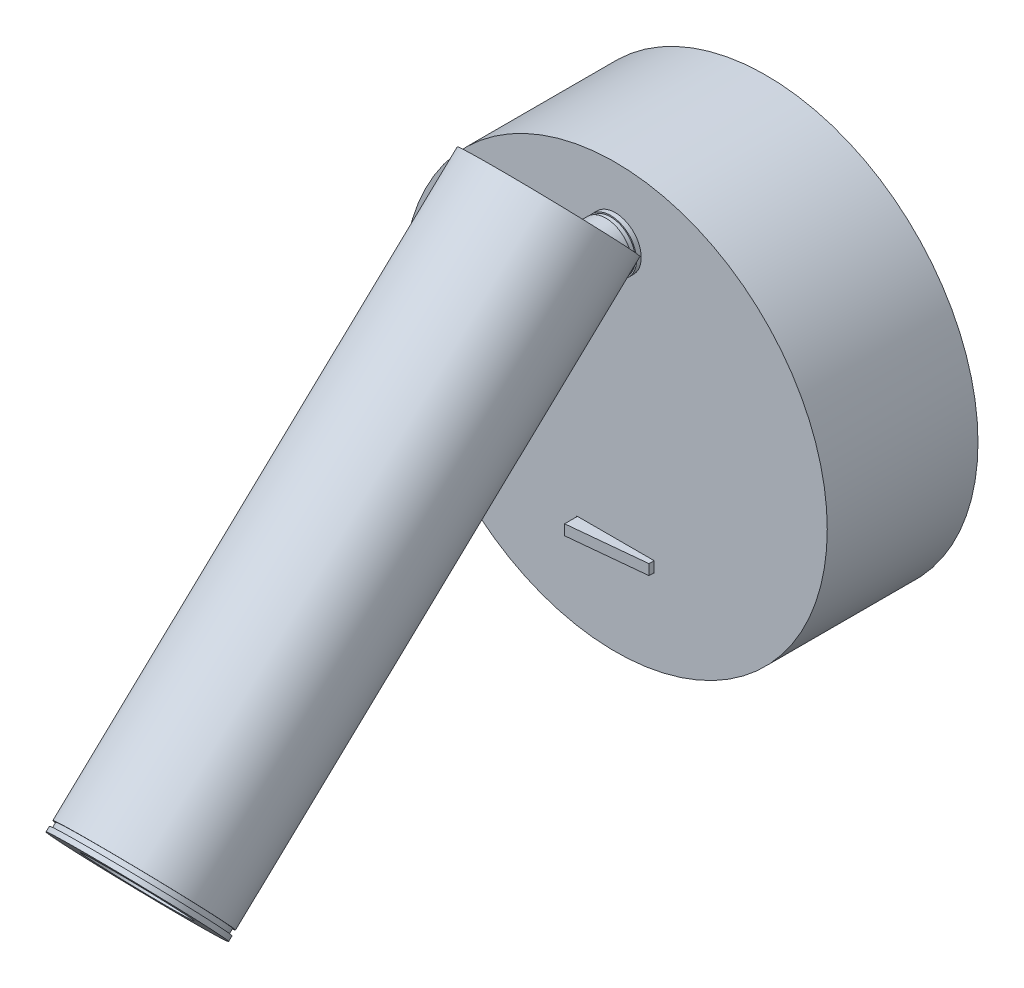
ISO-10303-21;
HEADER;
FILE_DESCRIPTION(('STEP AP214'),'2;1');
FILE_NAME('part.step','',(''),(''),'','','');
FILE_SCHEMA(('AUTOMOTIVE_DESIGN { 1 0 10303 214 1 1 1 1 }'));
ENDSEC;
DATA;
#1=APPLICATION_CONTEXT('core data for automotive mechanical design processes');
#2=APPLICATION_PROTOCOL_DEFINITION('international standard','automotive_design',2000,#1);
#3=PRODUCT_CONTEXT('',#1,'mechanical');
#4=PRODUCT('Part','Part','',(#3));
#5=PRODUCT_RELATED_PRODUCT_CATEGORY('part','',(#4));
#6=PRODUCT_DEFINITION_FORMATION('','',#4);
#7=PRODUCT_DEFINITION_CONTEXT('part definition',#1,'design');
#8=PRODUCT_DEFINITION('design','',#6,#7);
#9=PRODUCT_DEFINITION_SHAPE('','',#8);
#10=(LENGTH_UNIT() NAMED_UNIT(*) SI_UNIT(.MILLI.,.METRE.));
#11=(NAMED_UNIT(*) PLANE_ANGLE_UNIT() SI_UNIT($,.RADIAN.));
#12=(NAMED_UNIT(*) SI_UNIT($,.STERADIAN.) SOLID_ANGLE_UNIT());
#13=UNCERTAINTY_MEASURE_WITH_UNIT(LENGTH_MEASURE(1.E-05),#10,'distance_accuracy_value','');
#14=(GEOMETRIC_REPRESENTATION_CONTEXT(3) GLOBAL_UNCERTAINTY_ASSIGNED_CONTEXT((#13)) GLOBAL_UNIT_ASSIGNED_CONTEXT((#10,
#11,#12)) REPRESENTATION_CONTEXT('',''));
#15=CARTESIAN_POINT('',(0.,0.,0.));
#16=DIRECTION('',(0.,0.,1.));
#17=DIRECTION('',(1.,0.,0.));
#18=AXIS2_PLACEMENT_3D('',#15,#16,#17);
#19=CARTESIAN_POINT('',(-8.1430770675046,-26.4426643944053,35.));
#20=DIRECTION('',(0.,1.,0.));
#21=DIRECTION('',(0.,0.,1.));
#22=AXIS2_PLACEMENT_3D('',#19,#20,#21);
#23=PLANE('',#22);
#24=DIRECTION('',(0.,0.,-1.));
#25=VECTOR('',#24,1.);
#26=CARTESIAN_POINT('',(8.1430770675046,-26.4426643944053,35.));
#27=LINE('',#26,#25);
#28=CARTESIAN_POINT('',(8.1430770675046,-26.4426643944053,33.));
#29=VERTEX_POINT('',#28);
#30=CARTESIAN_POINT('',(8.1430770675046,-26.4426643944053,31.));
#31=VERTEX_POINT('',#30);
#32=EDGE_CURVE('E91',#29,#31,#27,.T.);
#33=ORIENTED_EDGE('',*,*,#32,.F.);
#34=DIRECTION('',(-0.995037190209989,0.,0.099503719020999));
#35=VECTOR('',#34,1.);
#36=CARTESIAN_POINT('',(-11.8569229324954,-26.4426643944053,35.));
#37=LINE('',#36,#35);
#38=CARTESIAN_POINT('',(-8.1430770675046,-26.4426643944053,34.6286154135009));
#39=VERTEX_POINT('',#38);
#40=EDGE_CURVE('E12',#29,#39,#37,.T.);
#41=ORIENTED_EDGE('',*,*,#40,.T.);
#42=DIRECTION('',(0.,0.,-1.));
#43=VECTOR('',#42,1.);
#44=CARTESIAN_POINT('',(-8.1430770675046,-26.4426643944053,35.));
#45=LINE('',#44,#43);
#46=CARTESIAN_POINT('',(-8.1430770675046,-26.4426643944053,31.));
#47=VERTEX_POINT('',#46);
#48=EDGE_CURVE('E110',#39,#47,#45,.T.);
#49=ORIENTED_EDGE('',*,*,#48,.T.);
#50=DIRECTION('',(1.,0.,0.));
#51=VECTOR('',#50,1.);
#52=CARTESIAN_POINT('',(-8.1430770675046,-26.4426643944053,31.));
#53=LINE('',#52,#51);
#54=EDGE_CURVE('E105',#47,#31,#53,.T.);
#55=ORIENTED_EDGE('',*,*,#54,.T.);
#56=EDGE_LOOP('',(#33,#41,#49,#55));
#57=FACE_BOUND('',#56,.T.);
#58=ADVANCED_FACE('F50',(#57),#23,.F.);
#59=CARTESIAN_POINT('',(8.1430770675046,-26.4426643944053,35.));
#60=DIRECTION('',(-1.,0.,0.));
#61=DIRECTION('',(0.,0.,1.));
#62=AXIS2_PLACEMENT_3D('',#59,#60,#61);
#63=PLANE('',#62);
#64=DIRECTION('',(0.,0.,-1.));
#65=VECTOR('',#64,1.);
#66=CARTESIAN_POINT('',(8.1430770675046,-24.2360908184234,35.));
#67=LINE('',#66,#65);
#68=CARTESIAN_POINT('',(8.1430770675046,-24.2360908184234,33.));
#69=VERTEX_POINT('',#68);
#70=CARTESIAN_POINT('',(8.1430770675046,-24.2360908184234,31.));
#71=VERTEX_POINT('',#70);
#72=EDGE_CURVE('E99',#69,#71,#67,.T.);
#73=ORIENTED_EDGE('',*,*,#72,.F.);
#74=DIRECTION('',(0.,-1.,0.));
#75=VECTOR('',#74,1.);
#76=CARTESIAN_POINT('',(8.1430770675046,-26.4426643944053,33.));
#77=LINE('',#76,#75);
#78=EDGE_CURVE('E58',#69,#29,#77,.T.);
#79=ORIENTED_EDGE('',*,*,#78,.T.);
#80=ORIENTED_EDGE('',*,*,#32,.T.);
#81=DIRECTION('',(0.,1.,0.));
#82=VECTOR('',#81,1.);
#83=CARTESIAN_POINT('',(8.1430770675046,-26.4426643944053,31.));
#84=LINE('',#83,#82);
#85=EDGE_CURVE('E94',#31,#71,#84,.T.);
#86=ORIENTED_EDGE('',*,*,#85,.T.);
#87=EDGE_LOOP('',(#73,#79,#80,#86));
#88=FACE_BOUND('',#87,.T.);
#89=ADVANCED_FACE('F93',(#88),#63,.F.);
#90=CARTESIAN_POINT('',(8.1430770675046,-24.2360908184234,35.));
#91=DIRECTION('',(0.,-1.,0.));
#92=DIRECTION('',(0.,0.,-1.));
#93=AXIS2_PLACEMENT_3D('',#90,#91,#92);
#94=PLANE('',#93);
#95=DIRECTION('',(0.,0.,-1.));
#96=VECTOR('',#95,1.);
#97=CARTESIAN_POINT('',(-8.1430770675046,-24.2360908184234,35.));
#98=LINE('',#97,#96);
#99=CARTESIAN_POINT('',(-8.1430770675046,-24.2360908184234,34.6286154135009));
#100=VERTEX_POINT('',#99);
#101=CARTESIAN_POINT('',(-8.1430770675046,-24.2360908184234,31.));
#102=VERTEX_POINT('',#101);
#103=EDGE_CURVE('E118',#100,#102,#98,.T.);
#104=ORIENTED_EDGE('',*,*,#103,.F.);
#105=DIRECTION('',(0.995037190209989,0.,-0.099503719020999));
#106=VECTOR('',#105,1.);
#107=CARTESIAN_POINT('',(-11.8569229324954,-24.2360908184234,35.));
#108=LINE('',#107,#106);
#109=EDGE_CURVE('E71',#100,#69,#108,.T.);
#110=ORIENTED_EDGE('',*,*,#109,.T.);
#111=ORIENTED_EDGE('',*,*,#72,.T.);
#112=DIRECTION('',(-1.,0.,0.));
#113=VECTOR('',#112,1.);
#114=CARTESIAN_POINT('',(8.1430770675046,-24.2360908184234,31.));
#115=LINE('',#114,#113);
#116=EDGE_CURVE('E107',#71,#102,#115,.T.);
#117=ORIENTED_EDGE('',*,*,#116,.T.);
#118=EDGE_LOOP('',(#104,#110,#111,#117));
#119=FACE_BOUND('',#118,.T.);
#120=ADVANCED_FACE('F124',(#119),#94,.F.);
#121=CARTESIAN_POINT('',(-8.1430770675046,-24.2360908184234,35.));
#122=DIRECTION('',(1.,0.,0.));
#123=DIRECTION('',(0.,0.,-1.));
#124=AXIS2_PLACEMENT_3D('',#121,#122,#123);
#125=PLANE('',#124);
#126=ORIENTED_EDGE('',*,*,#48,.F.);
#127=DIRECTION('',(0.,1.,0.));
#128=VECTOR('',#127,1.);
#129=CARTESIAN_POINT('',(-8.1430770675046,0.,34.6286154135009));
#130=LINE('',#129,#128);
#131=EDGE_CURVE('E98',#39,#100,#130,.T.);
#132=ORIENTED_EDGE('',*,*,#131,.T.);
#133=ORIENTED_EDGE('',*,*,#103,.T.);
#134=DIRECTION('',(0.,-1.,0.));
#135=VECTOR('',#134,1.);
#136=CARTESIAN_POINT('',(-8.1430770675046,-24.2360908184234,31.));
#137=LINE('',#136,#135);
#138=EDGE_CURVE('E115',#102,#47,#137,.T.);
#139=ORIENTED_EDGE('',*,*,#138,.T.);
#140=EDGE_LOOP('',(#126,#132,#133,#139));
#141=FACE_BOUND('',#140,.T.);
#142=ADVANCED_FACE('F123',(#141),#125,.F.);
#143=CARTESIAN_POINT('',(0.,0.,31.));
#144=DIRECTION('',(0.,0.,1.));
#145=DIRECTION('',(1.,0.,0.));
#146=AXIS2_PLACEMENT_3D('',#143,#144,#145);
#147=PLANE('',#146);
#148=ORIENTED_EDGE('',*,*,#54,.F.);
#149=ORIENTED_EDGE('',*,*,#138,.F.);
#150=ORIENTED_EDGE('',*,*,#116,.F.);
#151=ORIENTED_EDGE('',*,*,#85,.F.);
#152=EDGE_LOOP('',(#148,#149,#150,#151));
#153=FACE_BOUND('',#152,.T.);
#154=ADVANCED_FACE('F103',(#153),#147,.F.);
#155=CARTESIAN_POINT('',(-11.8569229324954,0.,35.));
#156=DIRECTION('',(0.099503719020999,0.,0.995037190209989));
#157=DIRECTION('',(0.,-1.,0.));
#158=AXIS2_PLACEMENT_3D('',#155,#156,#157);
#159=PLANE('',#158);
#160=ORIENTED_EDGE('',*,*,#40,.F.);
#161=ORIENTED_EDGE('',*,*,#78,.F.);
#162=ORIENTED_EDGE('',*,*,#109,.F.);
#163=ORIENTED_EDGE('',*,*,#131,.F.);
#164=EDGE_LOOP('',(#160,#161,#162,#163));
#165=FACE_BOUND('',#164,.T.);
#166=ADVANCED_FACE('F52',(#165),#159,.T.);
#167=CLOSED_SHELL('',(#58,#89,#120,#142,#154,#166));
#168=MANIFOLD_SOLID_BREP('B2',#167);
#169=CARTESIAN_POINT('',(0.,30.218938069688,59.7984728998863));
#170=DIRECTION('',(0.,0.,-1.));
#171=DIRECTION('',(-1.,0.,0.));
#172=AXIS2_PLACEMENT_3D('',#169,#170,#171);
#173=CYLINDRICAL_SURFACE('',#172,5.5);
#174=CARTESIAN_POINT('',(0.,30.218938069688,59.7984728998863));
#175=DIRECTION('',(0.,0.,1.));
#176=DIRECTION('',(1.,0.,0.));
#177=AXIS2_PLACEMENT_3D('',#174,#175,#176);
#178=CIRCLE('',#177,5.5);
#179=CARTESIAN_POINT('',(5.5,30.218938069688,59.7984728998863));
#180=VERTEX_POINT('',#179);
#181=EDGE_CURVE('E49',#180,#180,#178,.T.);
#182=ORIENTED_EDGE('',*,*,#181,.F.);
#183=EDGE_LOOP('',(#182));
#184=FACE_BOUND('',#183,.T.);
#185=CARTESIAN_POINT('',(0.,30.218938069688,39.7984728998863));
#186=DIRECTION('',(0.,0.,1.));
#187=DIRECTION('',(1.,0.,0.));
#188=AXIS2_PLACEMENT_3D('',#185,#186,#187);
#189=CIRCLE('',#188,5.5);
#190=CARTESIAN_POINT('',(5.5,30.218938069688,39.7984728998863));
#191=VERTEX_POINT('',#190);
#192=EDGE_CURVE('E187',#191,#191,#189,.T.);
#193=ORIENTED_EDGE('',*,*,#192,.T.);
#194=EDGE_LOOP('',(#193));
#195=FACE_BOUND('',#194,.T.);
#196=ADVANCED_FACE('F184',(#184,#195),#173,.T.);
#197=CARTESIAN_POINT('',(0.,30.218938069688,59.7984728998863));
#198=DIRECTION('',(0.,0.,1.));
#199=DIRECTION('',(1.,0.,0.));
#200=AXIS2_PLACEMENT_3D('',#197,#198,#199);
#201=PLANE('',#200);
#202=ORIENTED_EDGE('',*,*,#181,.T.);
#203=EDGE_LOOP('',(#202));
#204=FACE_BOUND('',#203,.T.);
#205=ADVANCED_FACE('F199',(#204),#201,.T.);
#206=CARTESIAN_POINT('',(0.,30.218938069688,39.7984728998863));
#207=DIRECTION('',(0.,0.,1.));
#208=DIRECTION('',(1.,0.,0.));
#209=AXIS2_PLACEMENT_3D('',#206,#207,#208);
#210=PLANE('',#209);
#211=ORIENTED_EDGE('',*,*,#192,.F.);
#212=EDGE_LOOP('',(#211));
#213=FACE_BOUND('',#212,.T.);
#214=ADVANCED_FACE('F197',(#213),#210,.F.);
#215=CLOSED_SHELL('',(#196,#205,#214));
#216=MANIFOLD_SOLID_BREP('B6',#215);
#217=CARTESIAN_POINT('',(0.,-37.4736596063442,133.494908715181));
#218=DIRECTION('',(0.,-0.685846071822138,0.727746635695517));
#219=DIRECTION('',(0.,-0.727746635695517,-0.685846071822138));
#220=AXIS2_PLACEMENT_3D('',#217,#218,#219);
#221=CYLINDRICAL_SURFACE('',#220,16.);
#222=CARTESIAN_POINT('',(0.,-36.1019674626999,132.03941544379));
#223=DIRECTION('',(0.,-0.685846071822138,0.727746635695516));
#224=DIRECTION('',(0.,-0.727746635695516,-0.685846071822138));
#225=AXIS2_PLACEMENT_3D('',#222,#223,#224);
#226=CIRCLE('',#225,16.);
#227=CARTESIAN_POINT('',(0.,-47.7459136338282,121.065878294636));
#228=VERTEX_POINT('',#227);
#229=EDGE_CURVE('E323',#228,#228,#226,.T.);
#230=ORIENTED_EDGE('',*,*,#229,.F.);
#231=EDGE_LOOP('',(#230));
#232=FACE_BOUND('',#231,.T.);
#233=DIRECTION('',(0.,-0.685846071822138,0.727746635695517));
#234=VECTOR('',#233,1.);
#235=CARTESIAN_POINT('',(5.5,-48.4080376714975,123.190085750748));
#236=LINE('',#235,#234);
#237=CARTESIAN_POINT('',(5.49999999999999,33.893490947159,35.8604894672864));
#238=VERTEX_POINT('',#237);
#239=CARTESIAN_POINT('',(5.5,1.80124637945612,69.913353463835));
#240=VERTEX_POINT('',#239);
#241=EDGE_CURVE('E352',#238,#240,#236,.T.);
#242=ORIENTED_EDGE('',*,*,#241,.F.);
#243=CARTESIAN_POINT('',(0.,44.8278690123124,46.1653124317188));
#244=DIRECTION('',(0.,0.685846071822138,-0.727746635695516));
#245=DIRECTION('',(0.,0.727746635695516,0.685846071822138));
#246=AXIS2_PLACEMENT_3D('',#243,#244,#245);
#247=CIRCLE('',#246,16.);
#248=CARTESIAN_POINT('',(-5.5,33.893490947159,35.8604894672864));
#249=VERTEX_POINT('',#248);
#250=EDGE_CURVE('E389',#249,#238,#247,.T.);
#251=ORIENTED_EDGE('',*,*,#250,.F.);
#252=DIRECTION('',(0.,-0.685846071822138,0.727746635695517));
#253=VECTOR('',#252,1.);
#254=CARTESIAN_POINT('',(-5.5,-48.4080376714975,123.190085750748));
#255=LINE('',#254,#253);
#256=CARTESIAN_POINT('',(-5.5,1.80124637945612,69.913353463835));
#257=VERTEX_POINT('',#256);
#258=EDGE_CURVE('E312',#249,#257,#255,.T.);
#259=ORIENTED_EDGE('',*,*,#258,.T.);
#260=CARTESIAN_POINT('',(5.5,1.80124639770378,69.9133534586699));
#261=CARTESIAN_POINT('',(5.35780118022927,1.70369270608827,69.9409666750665));
#262=CARTESIAN_POINT('',(5.21322529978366,1.60923429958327,69.9673734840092));
#263=CARTESIAN_POINT('',(4.91938867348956,1.42693784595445,70.0177886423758));
#264=CARTESIAN_POINT('',(4.77012421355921,1.33910524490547,70.0417950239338));
#265=CARTESIAN_POINT('',(4.46717693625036,1.17063123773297,70.0873839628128));
#266=CARTESIAN_POINT('',(4.3134931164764,1.08999148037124,70.1089659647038));
#267=CARTESIAN_POINT('',(4.00131229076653,0.936088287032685,70.1497820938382));
#268=CARTESIAN_POINT('',(3.84279705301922,0.86285893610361,70.1690054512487));
#269=CARTESIAN_POINT('',(3.52195360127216,0.724691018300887,70.2049806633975));
#270=CARTESIAN_POINT('',(3.3596262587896,0.659750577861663,70.2217330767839));
#271=CARTESIAN_POINT('',(3.03152871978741,0.538613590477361,70.2527606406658));
#272=CARTESIAN_POINT('',(2.86575874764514,0.482416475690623,70.2670359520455));
#273=CARTESIAN_POINT('',(2.44635581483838,0.353019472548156,70.2997106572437));
#274=CARTESIAN_POINT('',(2.1907725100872,0.285637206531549,70.3165334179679));
#275=CARTESIAN_POINT('',(1.67446623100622,0.172948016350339,70.344504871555));
#276=CARTESIAN_POINT('',(1.41374289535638,0.127642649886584,70.3556531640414));
#277=CARTESIAN_POINT('',(0.889876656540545,0.0600830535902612,70.3722296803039));
#278=CARTESIAN_POINT('',(0.626742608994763,0.0377644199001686,70.3776738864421));
#279=CARTESIAN_POINT('',(0.0994884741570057,0.0164086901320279,70.3828839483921));
#280=CARTESIAN_POINT('',(-0.164631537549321,0.0173698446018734,70.3826502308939));
#281=CARTESIAN_POINT('',(-0.677151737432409,0.0418507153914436,70.3766761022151));
#282=CARTESIAN_POINT('',(-0.925616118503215,0.0641243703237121,70.3712398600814));
#283=CARTESIAN_POINT('',(-1.41970295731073,0.129030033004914,70.355310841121));
#284=CARTESIAN_POINT('',(-1.66532541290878,0.171662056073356,70.3448180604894));
#285=CARTESIAN_POINT('',(-2.15258369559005,0.27665802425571,70.3187676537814));
#286=CARTESIAN_POINT('',(-2.39420972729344,0.33906453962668,70.3031990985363));
#287=CARTESIAN_POINT('',(-2.87143224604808,0.482548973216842,70.2670291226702));
#288=CARTESIAN_POINT('',(-3.10702932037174,0.563625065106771,70.246428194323));
#289=CARTESIAN_POINT('',(-3.5307749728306,0.727644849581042,70.2042235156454));
#290=CARTESIAN_POINT('',(-3.72007733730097,0.807835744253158,70.1834106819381));
#291=CARTESIAN_POINT('',(-4.09315438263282,0.979353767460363,70.1383761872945));
#292=CARTESIAN_POINT('',(-4.27692894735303,1.07068112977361,70.1141544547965));
#293=CARTESIAN_POINT('',(-4.63760615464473,1.26319070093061,70.0624398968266));
#294=CARTESIAN_POINT('',(-4.81453736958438,1.36432387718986,70.0349632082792));
#295=CARTESIAN_POINT('',(-5.16207806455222,1.575959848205,69.9766649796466));
#296=CARTESIAN_POINT('',(-5.33268910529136,1.68646030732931,69.9458442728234));
#297=CARTESIAN_POINT('',(-5.5,1.80124639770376,69.9133534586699));
#298=B_SPLINE_CURVE_WITH_KNOTS('',3,(#260,#261,#262,#263,#264,#265,#266,#267,#268,#269,#270,
#271,#272,#273,#274,#275,#276,#277,#278,#279,#280,#281,#282,#283,#284,#285,#286,#287,#288,#289,
#290,#291,#292,#293,#294,#295,#296,#297),.UNSPECIFIED.,.F.,.F.,(4,2,2,2,2,2,2,2,2,2,2,2,2,2,2,2,
2,2,4),(0.,0.523900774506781,1.04822758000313,1.57267426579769,2.09943293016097,
2.62607231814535,3.1526774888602,3.94617420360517,4.73972689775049,5.53105013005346,
6.32231389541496,7.06997321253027,7.81763309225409,8.56691358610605,9.31612081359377,
9.93563566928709,10.5551635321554,11.1717393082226,11.7881617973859),.UNSPECIFIED.);
#299=EDGE_CURVE('E322',#240,#257,#298,.T.);
#300=ORIENTED_EDGE('',*,*,#299,.F.);
#301=EDGE_LOOP('',(#242,#251,#259,#300));
#302=FACE_BOUND('',#301,.T.);
#303=ADVANCED_FACE('F234',(#232,#302),#221,.T.);
#304=CARTESIAN_POINT('',(0.,30.218938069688,64.));
#305=DIRECTION('',(0.,0.,-1.));
#306=DIRECTION('',(-1.,0.,0.));
#307=AXIS2_PLACEMENT_3D('',#304,#305,#306);
#308=CYLINDRICAL_SURFACE('',#307,5.5);
#309=CARTESIAN_POINT('',(-5.47785071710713,29.7258341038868,51.4258123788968));
#310=CARTESIAN_POINT('',(-5.49084023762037,29.8702872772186,51.2826151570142));
#311=CARTESIAN_POINT('',(-5.49809807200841,30.0147524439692,51.1389201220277));
#312=CARTESIAN_POINT('',(-5.50125007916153,30.3033726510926,50.8509036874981));
#313=CARTESIAN_POINT('',(-5.4971367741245,30.4475274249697,50.7065819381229));
#314=CARTESIAN_POINT('',(-5.47762640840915,30.7350453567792,50.4178269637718));
#315=CARTESIAN_POINT('',(-5.46222591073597,30.8784082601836,50.2733937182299));
#316=CARTESIAN_POINT('',(-5.41995181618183,31.1651483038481,49.9836432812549));
#317=CARTESIAN_POINT('',(-5.39297732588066,31.3085142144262,49.8383296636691));
#318=CARTESIAN_POINT('',(-5.32747409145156,31.5934888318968,49.5486449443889));
#319=CARTESIAN_POINT('',(-5.28894794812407,31.7350979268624,49.4042736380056));
#320=CARTESIAN_POINT('',(-5.20019338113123,32.0160717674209,49.1170271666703));
#321=CARTESIAN_POINT('',(-5.14996810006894,32.1554371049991,48.9741516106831));
#322=CARTESIAN_POINT('',(-5.02947062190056,32.4513104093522,48.6700299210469));
#323=CARTESIAN_POINT('',(-4.95735342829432,32.6073982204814,48.5090999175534));
#324=CARTESIAN_POINT('',(-4.79698198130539,32.9150566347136,48.1910056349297));
#325=CARTESIAN_POINT('',(-4.70872922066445,33.066627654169,48.033841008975));
#326=CARTESIAN_POINT('',(-4.51570721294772,33.3637248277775,47.7249745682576));
#327=CARTESIAN_POINT('',(-4.4109849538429,33.5092667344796,47.5732586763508));
#328=CARTESIAN_POINT('',(-4.18411354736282,33.79332220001,47.2764423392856));
#329=CARTESIAN_POINT('',(-4.06197088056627,33.9318383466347,47.1313394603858));
#330=CARTESIAN_POINT('',(-3.83955053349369,34.1590932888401,46.8927595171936));
#331=CARTESIAN_POINT('',(-3.74399123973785,34.2501122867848,46.7970522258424));
#332=CARTESIAN_POINT('',(-3.54382620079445,34.4271641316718,46.6106182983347));
#333=CARTESIAN_POINT('',(-3.43921896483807,34.5131961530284,46.5198924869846));
#334=CARTESIAN_POINT('',(-3.11170470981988,34.762331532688,46.2568233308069));
#335=CARTESIAN_POINT('',(-2.87473256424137,34.9168638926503,46.0931787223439));
#336=CARTESIAN_POINT('',(-2.42108618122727,35.162518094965,45.8325353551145));
#337=CARTESIAN_POINT('',(-2.21182027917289,35.2600856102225,45.7288240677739));
#338=CARTESIAN_POINT('',(-1.88277568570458,35.3879843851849,45.5927185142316));
#339=CARTESIAN_POINT('',(-1.77053727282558,35.4275501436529,45.5505847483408));
#340=CARTESIAN_POINT('',(-1.54150431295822,35.4998627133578,45.4735406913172));
#341=CARTESIAN_POINT('',(-1.42471193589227,35.5326127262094,45.4386270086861));
#342=CARTESIAN_POINT('',(-1.18606464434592,35.5909476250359,45.376414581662));
#343=CARTESIAN_POINT('',(-1.06417138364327,35.6164592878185,45.349193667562));
#344=CARTESIAN_POINT('',(-0.817335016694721,35.6593102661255,45.3034599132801));
#345=CARTESIAN_POINT('',(-0.692391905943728,35.6766495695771,45.2849470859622));
#346=CARTESIAN_POINT('',(-0.440688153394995,35.7027131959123,45.2571158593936));
#347=CARTESIAN_POINT('',(-0.313928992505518,35.7114441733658,45.2477903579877));
#348=CARTESIAN_POINT('',(-0.0597758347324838,35.7200821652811,45.2385642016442));
#349=CARTESIAN_POINT('',(0.0676180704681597,35.7199904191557,45.2386622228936));
#350=CARTESIAN_POINT('',(0.303270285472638,35.7116466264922,45.2475740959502));
#351=CARTESIAN_POINT('',(0.411622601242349,35.7045807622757,45.2551210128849));
#352=CARTESIAN_POINT('',(0.627082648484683,35.6841442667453,45.2769444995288));
#353=CARTESIAN_POINT('',(0.734189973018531,35.6707716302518,45.2912232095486));
#354=CARTESIAN_POINT('',(0.946362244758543,35.6379712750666,45.3262358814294));
#355=CARTESIAN_POINT('',(1.05142776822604,35.6185452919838,45.3469679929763));
#356=CARTESIAN_POINT('',(1.25896532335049,35.5739616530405,45.3945314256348));
#357=CARTESIAN_POINT('',(1.36143629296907,35.5488016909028,45.4213652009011));
#358=CARTESIAN_POINT('',(1.56440704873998,35.492821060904,45.4810427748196));
#359=CARTESIAN_POINT('',(1.66487002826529,35.4619379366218,45.5139528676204));
#360=CARTESIAN_POINT('',(1.86219192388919,35.3951432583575,45.5850929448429));
#361=CARTESIAN_POINT('',(1.9590496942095,35.3592301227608,45.6233246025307));
#362=CARTESIAN_POINT('',(2.24370961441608,35.2446307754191,45.7452474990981));
#363=CARTESIAN_POINT('',(2.4256769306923,35.159062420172,45.8361903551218));
#364=CARTESIAN_POINT('',(2.86942388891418,34.9211153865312,46.0886840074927));
#365=CARTESIAN_POINT('',(3.11919367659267,34.7580732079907,46.2613459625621));
#366=CARTESIAN_POINT('',(3.46285457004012,34.4944054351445,46.5397193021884));
#367=CARTESIAN_POINT('',(3.5723966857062,34.4031666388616,46.6359142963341));
#368=CARTESIAN_POINT('',(3.78146676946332,34.2152163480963,46.8337605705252));
#369=CARTESIAN_POINT('',(3.88099480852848,34.1185048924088,46.9354118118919));
#370=CARTESIAN_POINT('',(4.10972716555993,33.8792412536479,47.1864688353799));
#371=CARTESIAN_POINT('',(4.23402848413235,33.7343717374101,47.338132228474));
#372=CARTESIAN_POINT('',(4.4640054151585,33.4373150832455,47.6482999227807));
#373=CARTESIAN_POINT('',(4.56967306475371,33.2851248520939,47.8068071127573));
#374=CARTESIAN_POINT('',(4.76326487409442,32.9748015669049,48.1290955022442));
#375=CARTESIAN_POINT('',(4.85117031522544,32.8166624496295,48.2928820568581));
#376=CARTESIAN_POINT('',(5.00977166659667,32.4958237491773,48.6241737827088));
#377=CARTESIAN_POINT('',(5.08047004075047,32.3331248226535,48.7916784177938));
#378=CARTESIAN_POINT('',(5.20722713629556,31.998761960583,49.1348126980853));
#379=CARTESIAN_POINT('',(5.26273554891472,31.8269785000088,49.3105295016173));
#380=CARTESIAN_POINT('',(5.35636132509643,31.4805285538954,49.6636725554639));
#381=CARTESIAN_POINT('',(5.39447593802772,31.3058616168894,49.8410990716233));
#382=CARTESIAN_POINT('',(5.48291029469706,30.7794103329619,50.373884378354));
#383=CARTESIAN_POINT('',(5.50767337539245,30.4242286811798,50.7307216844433));
#384=CARTESIAN_POINT('',(5.49638223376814,30.0114747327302,51.1420516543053));
#385=CARTESIAN_POINT('',(5.49392973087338,29.9543404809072,51.1989144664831));
#386=CARTESIAN_POINT('',(5.48723468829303,29.8400855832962,51.312477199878));
#387=CARTESIAN_POINT('',(5.48299325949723,29.7829649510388,51.3691772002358));
#388=CARTESIAN_POINT('',(5.47785071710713,29.7258341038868,51.4258123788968));
#389=B_SPLINE_CURVE_WITH_KNOTS('',3,(#309,#310,#311,#312,#313,#314,#315,#316,#317,#318,#319,
#320,#321,#322,#323,#324,#325,#326,#327,#328,#329,#330,#331,#332,#333,#334,#335,#336,#337,#338,
#339,#340,#341,#342,#343,#344,#345,#346,#347,#348,#349,#350,#351,#352,#353,#354,#355,#356,#357,
#358,#359,#360,#361,#362,#363,#364,#365,#366,#367,#368,#369,#370,#371,#372,#373,#374,#375,#376,
#377,#378,#379,#380,#381,#382,#383,#384,#385,#386,#387,#388),.UNSPECIFIED.,.F.,.F.,(4,2,2,2,2,2,
2,2,2,2,2,2,2,2,2,2,2,2,2,2,2,2,2,2,2,2,2,2,2,2,2,2,2,2,2,2,2,2,2,4),(0.,0.611356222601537,
1.22311457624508,1.83505929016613,2.45245046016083,3.0697027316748,3.68678938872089,
4.39270470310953,5.09855474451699,5.80242633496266,6.50603675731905,6.99471374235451,
7.48347139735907,8.45897418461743,9.21523023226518,9.59356413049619,9.97171990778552,
10.353574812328,10.7354302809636,11.1169903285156,11.4984967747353,11.8246377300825,
12.1508824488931,12.4770337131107,12.8033163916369,13.1333953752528,13.4635783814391,
14.1236918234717,15.1515429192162,15.66716304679,16.1827795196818,16.9131291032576,
17.643790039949,18.3752170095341,19.1065391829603,19.8616234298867,20.6168270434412,
22.1230588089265,22.364994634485,22.6067804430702),.UNSPECIFIED.);
#390=CARTESIAN_POINT('',(-4.92469606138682,32.6678906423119,48.4465000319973));
#391=VERTEX_POINT('',#390);
#392=CARTESIAN_POINT('',(4.92469606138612,32.6678906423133,48.4465000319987));
#393=VERTEX_POINT('',#392);
#394=EDGE_CURVE('E321',#391,#393,#389,.T.);
#395=ORIENTED_EDGE('',*,*,#394,.F.);
#396=CARTESIAN_POINT('',(0.,30.218938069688,46.1385477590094));
#397=DIRECTION('',(0.,-0.685846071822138,0.727746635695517));
#398=DIRECTION('',(0.,-0.727746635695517,-0.685846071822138));
#399=AXIS2_PLACEMENT_3D('',#396,#397,#398);
#400=ELLIPSE('',#399,7.55757530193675,5.5);
#401=EDGE_CURVE('E310',#393,#391,#400,.T.);
#402=ORIENTED_EDGE('',*,*,#401,.F.);
#403=EDGE_LOOP('',(#395,#402));
#404=FACE_BOUND('',#403,.T.);
#405=ADVANCED_FACE('F236',(#404),#308,.T.);
#406=CARTESIAN_POINT('',(0.,-36.1019674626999,132.03941544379));
#407=DIRECTION('',(0.,-0.685846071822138,0.727746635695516));
#408=DIRECTION('',(0.,-0.727746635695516,-0.685846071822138));
#409=AXIS2_PLACEMENT_3D('',#406,#407,#408);
#410=PLANE('',#409);
#411=CARTESIAN_POINT('',(0.,-36.1019674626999,132.03941544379));
#412=DIRECTION('',(0.,-0.685846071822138,0.727746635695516));
#413=DIRECTION('',(0.,-0.727746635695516,-0.685846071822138));
#414=AXIS2_PLACEMENT_3D('',#411,#412,#413);
#415=CIRCLE('',#414,15.5);
#416=CARTESIAN_POINT('',(0.,-47.3820403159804,121.408801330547));
#417=VERTEX_POINT('',#416);
#418=EDGE_CURVE('E335',#417,#417,#415,.T.);
#419=ORIENTED_EDGE('',*,*,#418,.F.);
#420=EDGE_LOOP('',(#419));
#421=FACE_BOUND('',#420,.T.);
#422=ORIENTED_EDGE('',*,*,#229,.T.);
#423=EDGE_LOOP('',(#422));
#424=FACE_BOUND('',#423,.T.);
#425=ADVANCED_FACE('F401',(#421,#424),#410,.T.);
#426=CARTESIAN_POINT('',(0.,-36.7878135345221,132.767162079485));
#427=DIRECTION('',(0.,-0.685846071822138,0.727746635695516));
#428=DIRECTION('',(0.,-0.727746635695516,-0.685846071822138));
#429=AXIS2_PLACEMENT_3D('',#426,#427,#428);
#430=PLANE('',#429);
#431=CARTESIAN_POINT('',(0.,-36.7878135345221,132.767162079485));
#432=DIRECTION('',(0.,-0.685846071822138,0.727746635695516));
#433=DIRECTION('',(0.,-0.727746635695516,-0.685846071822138));
#434=AXIS2_PLACEMENT_3D('',#431,#432,#433);
#435=CIRCLE('',#434,15.5);
#436=CARTESIAN_POINT('',(0.,-48.0678863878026,122.136547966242));
#437=VERTEX_POINT('',#436);
#438=EDGE_CURVE('E326',#437,#437,#435,.T.);
#439=ORIENTED_EDGE('',*,*,#438,.T.);
#440=EDGE_LOOP('',(#439));
#441=FACE_BOUND('',#440,.T.);
#442=CARTESIAN_POINT('',(0.,-36.7878135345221,132.767162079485));
#443=DIRECTION('',(0.,-0.685846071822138,0.727746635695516));
#444=DIRECTION('',(0.,-0.727746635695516,-0.685846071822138));
#445=AXIS2_PLACEMENT_3D('',#442,#443,#444);
#446=CIRCLE('',#445,16.);
#447=CARTESIAN_POINT('',(0.,-48.4317597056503,121.793624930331));
#448=VERTEX_POINT('',#447);
#449=EDGE_CURVE('E327',#448,#448,#446,.T.);
#450=ORIENTED_EDGE('',*,*,#449,.F.);
#451=EDGE_LOOP('',(#450));
#452=FACE_BOUND('',#451,.T.);
#453=ADVANCED_FACE('F406',(#441,#452),#430,.F.);
#454=CARTESIAN_POINT('',(0.,-36.1019674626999,132.03941544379));
#455=DIRECTION('',(0.,-0.685846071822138,0.727746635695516));
#456=DIRECTION('',(0.,-0.727746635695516,-0.685846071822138));
#457=AXIS2_PLACEMENT_3D('',#454,#455,#456);
#458=CYLINDRICAL_SURFACE('',#457,15.5);
#459=ORIENTED_EDGE('',*,*,#418,.T.);
#460=EDGE_LOOP('',(#459));
#461=FACE_BOUND('',#460,.T.);
#462=ORIENTED_EDGE('',*,*,#438,.F.);
#463=EDGE_LOOP('',(#462));
#464=FACE_BOUND('',#463,.T.);
#465=ADVANCED_FACE('F422',(#461,#464),#458,.T.);
#466=CARTESIAN_POINT('',(0.,-25.8297134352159,144.468445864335));
#467=DIRECTION('',(0.,0.685846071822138,-0.727746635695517));
#468=DIRECTION('',(0.,0.727746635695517,0.685846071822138));
#469=AXIS2_PLACEMENT_3D('',#466,#467,#468);
#470=PLANE('',#469);
#471=CARTESIAN_POINT('',(0.,-37.4736596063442,133.494908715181));
#472=DIRECTION('',(0.,-0.685846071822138,0.727746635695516));
#473=DIRECTION('',(0.,-0.727746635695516,-0.685846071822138));
#474=AXIS2_PLACEMENT_3D('',#471,#472,#473);
#475=CIRCLE('',#474,10.);
#476=CARTESIAN_POINT('',(0.,-44.7511259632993,126.636447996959));
#477=VERTEX_POINT('',#476);
#478=EDGE_CURVE('E330',#477,#477,#475,.T.);
#479=ORIENTED_EDGE('',*,*,#478,.F.);
#480=EDGE_LOOP('',(#479));
#481=FACE_BOUND('',#480,.T.);
#482=CARTESIAN_POINT('',(0.,-37.4736596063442,133.494908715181));
#483=DIRECTION('',(0.,-0.685846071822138,0.727746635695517));
#484=DIRECTION('',(0.,-0.727746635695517,-0.685846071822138));
#485=AXIS2_PLACEMENT_3D('',#482,#483,#484);
#486=CIRCLE('',#485,16.);
#487=CARTESIAN_POINT('',(0.,-49.1176057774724,122.521371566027));
#488=VERTEX_POINT('',#487);
#489=EDGE_CURVE('E331',#488,#488,#486,.T.);
#490=ORIENTED_EDGE('',*,*,#489,.T.);
#491=EDGE_LOOP('',(#490));
#492=FACE_BOUND('',#491,.T.);
#493=ADVANCED_FACE('F415',(#481,#492),#470,.F.);
#494=ORIENTED_EDGE('',*,*,#449,.T.);
#495=EDGE_LOOP('',(#494));
#496=FACE_BOUND('',#495,.T.);
#497=ORIENTED_EDGE('',*,*,#489,.F.);
#498=EDGE_LOOP('',(#497));
#499=FACE_BOUND('',#498,.T.);
#500=ADVANCED_FACE('F358',(#496,#499),#221,.T.);
#501=CARTESIAN_POINT('',(0.,-36.787813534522,132.767162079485));
#502=DIRECTION('',(0.,-0.685846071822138,0.727746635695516));
#503=DIRECTION('',(0.,-0.727746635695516,-0.685846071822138));
#504=AXIS2_PLACEMENT_3D('',#501,#502,#503);
#505=CYLINDRICAL_SURFACE('',#504,10.);
#506=CARTESIAN_POINT('',(0.,-36.787813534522,132.767162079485));
#507=DIRECTION('',(0.,-0.685846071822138,0.727746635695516));
#508=DIRECTION('',(0.,-0.727746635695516,-0.685846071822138));
#509=AXIS2_PLACEMENT_3D('',#506,#507,#508);
#510=CIRCLE('',#509,10.);
#511=CARTESIAN_POINT('',(0.,-44.0652798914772,125.908701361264));
#512=VERTEX_POINT('',#511);
#513=EDGE_CURVE('E342',#512,#512,#510,.T.);
#514=ORIENTED_EDGE('',*,*,#513,.F.);
#515=EDGE_LOOP('',(#514));
#516=FACE_BOUND('',#515,.T.);
#517=ORIENTED_EDGE('',*,*,#478,.T.);
#518=EDGE_LOOP('',(#517));
#519=FACE_BOUND('',#518,.T.);
#520=ADVANCED_FACE('F414',(#516,#519),#505,.F.);
#521=CARTESIAN_POINT('',(0.,-36.787813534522,132.767162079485));
#522=DIRECTION('',(0.,-0.685846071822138,0.727746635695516));
#523=DIRECTION('',(0.,-0.727746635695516,-0.685846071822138));
#524=AXIS2_PLACEMENT_3D('',#521,#522,#523);
#525=PLANE('',#524);
#526=ORIENTED_EDGE('',*,*,#513,.T.);
#527=EDGE_LOOP('',(#526));
#528=FACE_BOUND('',#527,.T.);
#529=ADVANCED_FACE('F369',(#528),#525,.T.);
#530=CARTESIAN_POINT('',(-5.5,15.1978064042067,63.6829797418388));
#531=DIRECTION('',(-1.,0.,0.));
#532=DIRECTION('',(0.,0.,1.));
#533=AXIS2_PLACEMENT_3D('',#530,#531,#532);
#534=PLANE('',#533);
#535=ORIENTED_EDGE('',*,*,#258,.F.);
#536=DIRECTION('',(0.,-0.727746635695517,-0.685846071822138));
#537=VECTOR('',#536,1.);
#538=CARTESIAN_POINT('',(-5.5,39.5263513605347,41.1690336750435));
#539=LINE('',#538,#537);
#540=CARTESIAN_POINT('',(-5.5,39.5263513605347,41.1690336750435));
#541=VERTEX_POINT('',#540);
#542=EDGE_CURVE('E298',#541,#249,#539,.T.);
#543=ORIENTED_EDGE('',*,*,#542,.F.);
#544=DIRECTION('',(0.,-0.685846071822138,0.727746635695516));
#545=VECTOR('',#544,1.);
#546=CARTESIAN_POINT('',(-5.5,39.5263513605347,41.1690336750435));
#547=LINE('',#546,#545);
#548=CARTESIAN_POINT('',(-5.5,32.6678906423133,48.4465000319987));
#549=VERTEX_POINT('',#548);
#550=EDGE_CURVE('E294',#541,#549,#547,.T.);
#551=ORIENTED_EDGE('',*,*,#550,.T.);
#552=CARTESIAN_POINT('',(-5.5,40.7041007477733,39.7984728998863));
#553=CARTESIAN_POINT('',(-5.5,19.7093243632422,63.1522129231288));
#554=CARTESIAN_POINT('',(-5.5,9.56578071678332,69.5214147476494));
#555=CARTESIAN_POINT('',(-5.5,-6.94696475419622,71.6444820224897));
#556=B_SPLINE_CURVE_WITH_KNOTS('',3,(#552,#553,#554,#555),.UNSPECIFIED.,.F.,.F.,(4,4),(0.,1.),.UNSPECIFIED.);
#557=EDGE_CURVE('E239',#549,#257,#556,.T.);
#558=ORIENTED_EDGE('',*,*,#557,.T.);
#559=EDGE_LOOP('',(#535,#543,#551,#558));
#560=FACE_BOUND('',#559,.T.);
#561=ADVANCED_FACE('F384',(#560),#534,.F.);
#562=CARTESIAN_POINT('',(5.5,15.1978064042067,63.6829797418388));
#563=DIRECTION('',(-1.,0.,0.));
#564=DIRECTION('',(0.,0.,1.));
#565=AXIS2_PLACEMENT_3D('',#562,#563,#564);
#566=PLANE('',#565);
#567=ORIENTED_EDGE('',*,*,#241,.T.);
#568=CARTESIAN_POINT('',(5.5,40.7041007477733,39.7984728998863));
#569=CARTESIAN_POINT('',(5.5,19.7093243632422,63.1522129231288));
#570=CARTESIAN_POINT('',(5.5,9.56578071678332,69.5214147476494));
#571=CARTESIAN_POINT('',(5.5,-6.94696475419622,71.6444820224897));
#572=B_SPLINE_CURVE_WITH_KNOTS('',3,(#568,#569,#570,#571),.UNSPECIFIED.,.F.,.F.,(4,4),(0.,1.),.UNSPECIFIED.);
#573=CARTESIAN_POINT('',(5.5,32.6678906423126,48.4465000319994));
#574=VERTEX_POINT('',#573);
#575=EDGE_CURVE('E182',#574,#240,#572,.T.);
#576=ORIENTED_EDGE('',*,*,#575,.F.);
#577=DIRECTION('',(0.,-0.685846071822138,0.727746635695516));
#578=VECTOR('',#577,1.);
#579=CARTESIAN_POINT('',(5.5,39.5263513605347,41.1690336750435));
#580=LINE('',#579,#578);
#581=CARTESIAN_POINT('',(5.5,39.5263513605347,41.1690336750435));
#582=VERTEX_POINT('',#581);
#583=EDGE_CURVE('E253',#582,#574,#580,.T.);
#584=ORIENTED_EDGE('',*,*,#583,.F.);
#585=DIRECTION('',(0.,0.727746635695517,0.685846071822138));
#586=VECTOR('',#585,1.);
#587=CARTESIAN_POINT('',(5.49999999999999,33.893490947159,35.8604894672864));
#588=LINE('',#587,#586);
#589=EDGE_CURVE('E390',#238,#582,#588,.T.);
#590=ORIENTED_EDGE('',*,*,#589,.F.);
#591=EDGE_LOOP('',(#567,#576,#584,#590));
#592=FACE_BOUND('',#591,.T.);
#593=ADVANCED_FACE('F367',(#592),#566,.T.);
#594=DIRECTION('',(-1.,0.,0.));
#595=VECTOR('',#594,1.);
#596=SURFACE_OF_LINEAR_EXTRUSION('',#572,#595);
#597=ORIENTED_EDGE('',*,*,#299,.T.);
#598=ORIENTED_EDGE('',*,*,#557,.F.);
#599=DIRECTION('',(-1.,0.,0.));
#600=VECTOR('',#599,1.);
#601=CARTESIAN_POINT('',(5.5,32.6678906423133,48.4465000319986));
#602=LINE('',#601,#600);
#603=EDGE_CURVE('E319',#549,#391,#602,.F.);
#604=ORIENTED_EDGE('',*,*,#603,.T.);
#605=ORIENTED_EDGE('',*,*,#394,.T.);
#606=EDGE_CURVE('E247',#393,#574,#602,.F.);
#607=ORIENTED_EDGE('',*,*,#606,.T.);
#608=ORIENTED_EDGE('',*,*,#575,.T.);
#609=EDGE_LOOP('',(#597,#598,#604,#605,#607,#608));
#610=FACE_BOUND('',#609,.T.);
#611=ADVANCED_FACE('F362',(#610),#596,.T.);
#612=CARTESIAN_POINT('',(0.,37.0773987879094,38.8610814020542));
#613=DIRECTION('',(0.,-0.685846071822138,0.727746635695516));
#614=DIRECTION('',(0.,-0.727746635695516,-0.685846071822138));
#615=AXIS2_PLACEMENT_3D('',#612,#613,#614);
#616=ELLIPSE('',#615,7.55757530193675,5.5);
#617=DIRECTION('',(0.,-0.685846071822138,0.727746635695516));
#618=VECTOR('',#617,1.);
#619=SURFACE_OF_LINEAR_EXTRUSION('',#616,#618);
#620=ORIENTED_EDGE('',*,*,#401,.T.);
#621=DIRECTION('',(0.,-0.685846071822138,0.727746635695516));
#622=VECTOR('',#621,1.);
#623=CARTESIAN_POINT('',(-4.92469606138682,39.5263513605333,41.1690336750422));
#624=LINE('',#623,#622);
#625=CARTESIAN_POINT('',(-4.92469606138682,39.5263513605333,41.1690336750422));
#626=VERTEX_POINT('',#625);
#627=EDGE_CURVE('E291',#626,#391,#624,.T.);
#628=ORIENTED_EDGE('',*,*,#627,.F.);
#629=CARTESIAN_POINT('',(4.92469606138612,39.5263513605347,41.1690336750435));
#630=VERTEX_POINT('',#629);
#631=EDGE_CURVE('E299',#630,#626,#616,.T.);
#632=ORIENTED_EDGE('',*,*,#631,.F.);
#633=DIRECTION('',(0.,-0.685846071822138,0.727746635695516));
#634=VECTOR('',#633,1.);
#635=CARTESIAN_POINT('',(4.92469606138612,39.5263513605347,41.1690336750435));
#636=LINE('',#635,#634);
#637=EDGE_CURVE('E396',#630,#393,#636,.T.);
#638=ORIENTED_EDGE('',*,*,#637,.T.);
#639=EDGE_LOOP('',(#620,#628,#632,#638));
#640=FACE_BOUND('',#639,.T.);
#641=ADVANCED_FACE('F308',(#640),#619,.F.);
#642=CARTESIAN_POINT('',(-4.92469606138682,39.5263513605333,41.1690336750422));
#643=DIRECTION('',(3.34477693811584E-12,0.727746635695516,0.685846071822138));
#644=DIRECTION('',(0.,-0.685846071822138,0.727746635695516));
#645=AXIS2_PLACEMENT_3D('',#642,#643,#644);
#646=PLANE('',#645);
#647=ORIENTED_EDGE('',*,*,#603,.F.);
#648=ORIENTED_EDGE('',*,*,#550,.F.);
#649=DIRECTION('',(-1.,2.4363757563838E-12,2.29164056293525E-12));
#650=VECTOR('',#649,1.);
#651=CARTESIAN_POINT('',(-4.92469606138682,39.5263513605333,41.1690336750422));
#652=LINE('',#651,#650);
#653=EDGE_CURVE('E287',#626,#541,#652,.T.);
#654=ORIENTED_EDGE('',*,*,#653,.F.);
#655=ORIENTED_EDGE('',*,*,#627,.T.);
#656=EDGE_LOOP('',(#647,#648,#654,#655));
#657=FACE_BOUND('',#656,.T.);
#658=ADVANCED_FACE('F289',(#657),#646,.F.);
#659=CARTESIAN_POINT('',(5.5,39.5263513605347,41.1690336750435));
#660=DIRECTION('',(0.,0.727746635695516,0.685846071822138));
#661=DIRECTION('',(0.,-0.685846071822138,0.727746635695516));
#662=AXIS2_PLACEMENT_3D('',#659,#660,#661);
#663=PLANE('',#662);
#664=ORIENTED_EDGE('',*,*,#606,.F.);
#665=ORIENTED_EDGE('',*,*,#637,.F.);
#666=DIRECTION('',(-1.,0.,0.));
#667=VECTOR('',#666,1.);
#668=CARTESIAN_POINT('',(5.5,39.5263513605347,41.1690336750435));
#669=LINE('',#668,#667);
#670=EDGE_CURVE('E303',#582,#630,#669,.T.);
#671=ORIENTED_EDGE('',*,*,#670,.F.);
#672=ORIENTED_EDGE('',*,*,#583,.T.);
#673=EDGE_LOOP('',(#664,#665,#671,#672));
#674=FACE_BOUND('',#673,.T.);
#675=ADVANCED_FACE('F513',(#674),#663,.F.);
#676=CARTESIAN_POINT('',(0.,37.0773987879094,38.8610814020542));
#677=DIRECTION('',(0.,0.685846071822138,-0.727746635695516));
#678=DIRECTION('',(0.,0.727746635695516,0.685846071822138));
#679=AXIS2_PLACEMENT_3D('',#676,#677,#678);
#680=PLANE('',#679);
#681=ORIENTED_EDGE('',*,*,#631,.T.);
#682=ORIENTED_EDGE('',*,*,#653,.T.);
#683=ORIENTED_EDGE('',*,*,#542,.T.);
#684=ORIENTED_EDGE('',*,*,#250,.T.);
#685=ORIENTED_EDGE('',*,*,#589,.T.);
#686=ORIENTED_EDGE('',*,*,#670,.T.);
#687=EDGE_LOOP('',(#681,#682,#683,#684,#685,#686));
#688=FACE_BOUND('',#687,.T.);
#689=ADVANCED_FACE('F302',(#688),#680,.T.);
#690=CLOSED_SHELL('',(#303,#405,#425,#453,#465,#493,#500,#520,#529,#561,#593,#611,#641,#658,
#675,#689));
#691=MANIFOLD_SOLID_BREP('B44',#690);
#692=CARTESIAN_POINT('',(0.,0.,0.));
#693=DIRECTION('',(0.,0.,1.));
#694=DIRECTION('',(1.,0.,0.));
#695=AXIS2_PLACEMENT_3D('',#692,#693,#694);
#696=PLANE('',#695);
#697=CARTESIAN_POINT('',(0.,0.,0.));
#698=DIRECTION('',(0.,0.,1.));
#699=DIRECTION('',(1.,0.,0.));
#700=AXIS2_PLACEMENT_3D('',#697,#698,#699);
#701=CIRCLE('',#700,45.);
#702=CARTESIAN_POINT('',(45.,0.,0.));
#703=VERTEX_POINT('',#702);
#704=EDGE_CURVE('E666',#703,#703,#701,.T.);
#705=ORIENTED_EDGE('',*,*,#704,.F.);
#706=EDGE_LOOP('',(#705));
#707=FACE_BOUND('',#706,.T.);
#708=ADVANCED_FACE('F562',(#707),#696,.F.);
#709=CARTESIAN_POINT('',(0.,0.,32.));
#710=DIRECTION('',(0.,0.,-1.));
#711=DIRECTION('',(-1.,0.,0.));
#712=AXIS2_PLACEMENT_3D('',#709,#710,#711);
#713=CYLINDRICAL_SURFACE('',#712,45.);
#714=CARTESIAN_POINT('',(0.,0.,32.));
#715=DIRECTION('',(0.,0.,1.));
#716=DIRECTION('',(1.,0.,0.));
#717=AXIS2_PLACEMENT_3D('',#714,#715,#716);
#718=CIRCLE('',#717,45.);
#719=CARTESIAN_POINT('',(45.,0.,32.));
#720=VERTEX_POINT('',#719);
#721=EDGE_CURVE('E571',#720,#720,#718,.T.);
#722=ORIENTED_EDGE('',*,*,#721,.F.);
#723=EDGE_LOOP('',(#722));
#724=FACE_BOUND('',#723,.T.);
#725=ORIENTED_EDGE('',*,*,#704,.T.);
#726=EDGE_LOOP('',(#725));
#727=FACE_BOUND('',#726,.T.);
#728=ADVANCED_FACE('F564',(#724,#727),#713,.T.);
#729=CARTESIAN_POINT('',(0.,0.,32.));
#730=DIRECTION('',(0.,0.,1.));
#731=DIRECTION('',(1.,0.,0.));
#732=AXIS2_PLACEMENT_3D('',#729,#730,#731);
#733=PLANE('',#732);
#734=DIRECTION('',(0.,1.,0.));
#735=VECTOR('',#734,1.);
#736=CARTESIAN_POINT('',(8.2430770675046,-24.1360908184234,32.));
#737=LINE('',#736,#735);
#738=CARTESIAN_POINT('',(8.2430770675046,-26.5426643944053,32.));
#739=VERTEX_POINT('',#738);
#740=CARTESIAN_POINT('',(8.2430770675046,-24.1360908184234,32.));
#741=VERTEX_POINT('',#740);
#742=EDGE_CURVE('E578',#739,#741,#737,.T.);
#743=ORIENTED_EDGE('',*,*,#742,.F.);
#744=DIRECTION('',(1.,0.,0.));
#745=VECTOR('',#744,1.);
#746=CARTESIAN_POINT('',(-8.2430770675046,-26.5426643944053,32.));
#747=LINE('',#746,#745);
#748=CARTESIAN_POINT('',(-8.2430770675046,-26.5426643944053,32.));
#749=VERTEX_POINT('',#748);
#750=EDGE_CURVE('E633',#749,#739,#747,.T.);
#751=ORIENTED_EDGE('',*,*,#750,.F.);
#752=DIRECTION('',(0.,-1.,0.));
#753=VECTOR('',#752,1.);
#754=CARTESIAN_POINT('',(-8.2430770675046,-24.1360908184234,32.));
#755=LINE('',#754,#753);
#756=CARTESIAN_POINT('',(-8.2430770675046,-24.1360908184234,32.));
#757=VERTEX_POINT('',#756);
#758=EDGE_CURVE('E642',#757,#749,#755,.T.);
#759=ORIENTED_EDGE('',*,*,#758,.F.);
#760=DIRECTION('',(-1.,0.,0.));
#761=VECTOR('',#760,1.);
#762=CARTESIAN_POINT('',(-8.2430770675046,-24.1360908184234,32.));
#763=LINE('',#762,#761);
#764=EDGE_CURVE('E613',#741,#757,#763,.T.);
#765=ORIENTED_EDGE('',*,*,#764,.F.);
#766=EDGE_LOOP('',(#743,#751,#759,#765));
#767=FACE_BOUND('',#766,.T.);
#768=CARTESIAN_POINT('',(0.,30.218938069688,32.));
#769=DIRECTION('',(0.,0.,1.));
#770=DIRECTION('',(1.,0.,0.));
#771=AXIS2_PLACEMENT_3D('',#768,#769,#770);
#772=CIRCLE('',#771,5.5);
#773=CARTESIAN_POINT('',(5.5,30.218938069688,32.));
#774=VERTEX_POINT('',#773);
#775=EDGE_CURVE('E662',#774,#774,#772,.T.);
#776=ORIENTED_EDGE('',*,*,#775,.F.);
#777=EDGE_LOOP('',(#776));
#778=FACE_BOUND('',#777,.T.);
#779=ORIENTED_EDGE('',*,*,#721,.T.);
#780=EDGE_LOOP('',(#779));
#781=FACE_BOUND('',#780,.T.);
#782=ADVANCED_FACE('F704',(#767,#778,#781),#733,.T.);
#783=CARTESIAN_POINT('',(0.,30.218938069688,64.));
#784=DIRECTION('',(0.,0.,-1.));
#785=DIRECTION('',(-1.,0.,0.));
#786=AXIS2_PLACEMENT_3D('',#783,#784,#785);
#787=CYLINDRICAL_SURFACE('',#786,5.5);
#788=ORIENTED_EDGE('',*,*,#775,.T.);
#789=EDGE_LOOP('',(#788));
#790=FACE_BOUND('',#789,.T.);
#791=CARTESIAN_POINT('',(0.,30.218938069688,33.));
#792=DIRECTION('',(0.,0.,1.));
#793=DIRECTION('',(1.,0.,0.));
#794=AXIS2_PLACEMENT_3D('',#791,#792,#793);
#795=CIRCLE('',#794,5.5);
#796=CARTESIAN_POINT('',(5.5,30.218938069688,33.));
#797=VERTEX_POINT('',#796);
#798=EDGE_CURVE('E658',#797,#797,#795,.T.);
#799=ORIENTED_EDGE('',*,*,#798,.F.);
#800=EDGE_LOOP('',(#799));
#801=FACE_BOUND('',#800,.T.);
#802=ADVANCED_FACE('F694',(#790,#801),#787,.T.);
#803=CARTESIAN_POINT('',(0.,30.218938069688,33.));
#804=DIRECTION('',(0.,0.,1.));
#805=DIRECTION('',(1.,0.,0.));
#806=AXIS2_PLACEMENT_3D('',#803,#804,#805);
#807=PLANE('',#806);
#808=CARTESIAN_POINT('',(0.,30.218938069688,33.));
#809=DIRECTION('',(0.,0.,1.));
#810=DIRECTION('',(1.,0.,0.));
#811=AXIS2_PLACEMENT_3D('',#808,#809,#810);
#812=CIRCLE('',#811,5.24024796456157);
#813=CARTESIAN_POINT('',(5.24024796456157,30.218938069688,33.));
#814=VERTEX_POINT('',#813);
#815=EDGE_CURVE('E649',#814,#814,#812,.T.);
#816=ORIENTED_EDGE('',*,*,#815,.F.);
#817=EDGE_LOOP('',(#816));
#818=FACE_BOUND('',#817,.T.);
#819=ORIENTED_EDGE('',*,*,#798,.T.);
#820=EDGE_LOOP('',(#819));
#821=FACE_BOUND('',#820,.T.);
#822=ADVANCED_FACE('F695',(#818,#821),#807,.T.);
#823=CARTESIAN_POINT('',(0.,30.218938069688,34.));
#824=DIRECTION('',(0.,0.,-1.));
#825=DIRECTION('',(-1.,0.,0.));
#826=AXIS2_PLACEMENT_3D('',#823,#824,#825);
#827=CYLINDRICAL_SURFACE('',#826,5.24024796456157);
#828=CARTESIAN_POINT('',(0.,30.218938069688,34.));
#829=DIRECTION('',(0.,0.,1.));
#830=DIRECTION('',(1.,0.,0.));
#831=AXIS2_PLACEMENT_3D('',#828,#829,#830);
#832=CIRCLE('',#831,5.24024796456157);
#833=CARTESIAN_POINT('',(5.24024796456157,30.218938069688,34.));
#834=VERTEX_POINT('',#833);
#835=EDGE_CURVE('E654',#834,#834,#832,.T.);
#836=ORIENTED_EDGE('',*,*,#835,.F.);
#837=EDGE_LOOP('',(#836));
#838=FACE_BOUND('',#837,.T.);
#839=ORIENTED_EDGE('',*,*,#815,.T.);
#840=EDGE_LOOP('',(#839));
#841=FACE_BOUND('',#840,.T.);
#842=ADVANCED_FACE('F685',(#838,#841),#827,.T.);
#843=CARTESIAN_POINT('',(0.,30.218938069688,34.));
#844=DIRECTION('',(0.,0.,1.));
#845=DIRECTION('',(1.,0.,0.));
#846=AXIS2_PLACEMENT_3D('',#843,#844,#845);
#847=PLANE('',#846);
#848=ORIENTED_EDGE('',*,*,#835,.T.);
#849=EDGE_LOOP('',(#848));
#850=FACE_BOUND('',#849,.T.);
#851=CARTESIAN_POINT('',(0.,30.218938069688,34.));
#852=DIRECTION('',(0.,0.,1.));
#853=DIRECTION('',(1.,0.,0.));
#854=AXIS2_PLACEMENT_3D('',#851,#852,#853);
#855=CIRCLE('',#854,5.5);
#856=CARTESIAN_POINT('',(5.5,30.218938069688,34.));
#857=VERTEX_POINT('',#856);
#858=EDGE_CURVE('E667',#857,#857,#855,.T.);
#859=ORIENTED_EDGE('',*,*,#858,.F.);
#860=EDGE_LOOP('',(#859));
#861=FACE_BOUND('',#860,.T.);
#862=ADVANCED_FACE('F683',(#850,#861),#847,.F.);
#863=ORIENTED_EDGE('',*,*,#858,.T.);
#864=EDGE_LOOP('',(#863));
#865=FACE_BOUND('',#864,.T.);
#866=CARTESIAN_POINT('',(0.,30.218938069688,39.7984728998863));
#867=DIRECTION('',(0.,0.,1.));
#868=DIRECTION('',(1.,0.,0.));
#869=AXIS2_PLACEMENT_3D('',#866,#867,#868);
#870=CIRCLE('',#869,5.5);
#871=CARTESIAN_POINT('',(5.5,30.218938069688,39.7984728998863));
#872=VERTEX_POINT('',#871);
#873=EDGE_CURVE('E232',#872,#872,#870,.T.);
#874=ORIENTED_EDGE('',*,*,#873,.F.);
#875=EDGE_LOOP('',(#874));
#876=FACE_BOUND('',#875,.T.);
#877=ADVANCED_FACE('F680',(#865,#876),#787,.T.);
#878=CARTESIAN_POINT('',(5.5,19.7093243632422,39.7984728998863));
#879=DIRECTION('',(0.,0.,1.));
#880=DIRECTION('',(1.,0.,0.));
#881=AXIS2_PLACEMENT_3D('',#878,#879,#880);
#882=PLANE('',#881);
#883=ORIENTED_EDGE('',*,*,#873,.T.);
#884=EDGE_LOOP('',(#883));
#885=FACE_BOUND('',#884,.T.);
#886=ADVANCED_FACE('F692',(#885),#882,.T.);
#887=CARTESIAN_POINT('',(8.2430770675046,-24.1360908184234,31.));
#888=DIRECTION('',(1.,0.,0.));
#889=DIRECTION('',(0.,0.,-1.));
#890=AXIS2_PLACEMENT_3D('',#887,#888,#889);
#891=PLANE('',#890);
#892=ORIENTED_EDGE('',*,*,#742,.T.);
#893=DIRECTION('',(0.,0.,1.));
#894=VECTOR('',#893,1.);
#895=CARTESIAN_POINT('',(8.2430770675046,-24.1360908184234,31.));
#896=LINE('',#895,#894);
#897=CARTESIAN_POINT('',(8.2430770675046,-24.1360908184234,31.));
#898=VERTEX_POINT('',#897);
#899=EDGE_CURVE('E601',#898,#741,#896,.T.);
#900=ORIENTED_EDGE('',*,*,#899,.F.);
#901=DIRECTION('',(0.,1.,0.));
#902=VECTOR('',#901,1.);
#903=CARTESIAN_POINT('',(8.2430770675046,-24.1360908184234,31.));
#904=LINE('',#903,#902);
#905=CARTESIAN_POINT('',(8.2430770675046,-26.5426643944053,31.));
#906=VERTEX_POINT('',#905);
#907=EDGE_CURVE('E629',#906,#898,#904,.T.);
#908=ORIENTED_EDGE('',*,*,#907,.F.);
#909=DIRECTION('',(0.,0.,1.));
#910=VECTOR('',#909,1.);
#911=CARTESIAN_POINT('',(8.2430770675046,-26.5426643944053,31.));
#912=LINE('',#911,#910);
#913=EDGE_CURVE('E586',#906,#739,#912,.T.);
#914=ORIENTED_EDGE('',*,*,#913,.T.);
#915=EDGE_LOOP('',(#892,#900,#908,#914));
#916=FACE_BOUND('',#915,.T.);
#917=ADVANCED_FACE('F773',(#916),#891,.F.);
#918=CARTESIAN_POINT('',(-8.2430770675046,-26.5426643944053,31.));
#919=DIRECTION('',(0.,-1.,0.));
#920=DIRECTION('',(0.,0.,-1.));
#921=AXIS2_PLACEMENT_3D('',#918,#919,#920);
#922=PLANE('',#921);
#923=ORIENTED_EDGE('',*,*,#750,.T.);
#924=ORIENTED_EDGE('',*,*,#913,.F.);
#925=DIRECTION('',(1.,0.,0.));
#926=VECTOR('',#925,1.);
#927=CARTESIAN_POINT('',(-8.2430770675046,-26.5426643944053,31.));
#928=LINE('',#927,#926);
#929=CARTESIAN_POINT('',(-8.2430770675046,-26.5426643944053,31.));
#930=VERTEX_POINT('',#929);
#931=EDGE_CURVE('E626',#930,#906,#928,.T.);
#932=ORIENTED_EDGE('',*,*,#931,.F.);
#933=DIRECTION('',(0.,0.,1.));
#934=VECTOR('',#933,1.);
#935=CARTESIAN_POINT('',(-8.2430770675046,-26.5426643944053,31.));
#936=LINE('',#935,#934);
#937=EDGE_CURVE('E618',#930,#749,#936,.T.);
#938=ORIENTED_EDGE('',*,*,#937,.T.);
#939=EDGE_LOOP('',(#923,#924,#932,#938));
#940=FACE_BOUND('',#939,.T.);
#941=ADVANCED_FACE('F781',(#940),#922,.F.);
#942=CARTESIAN_POINT('',(-8.2430770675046,-24.1360908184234,31.));
#943=DIRECTION('',(-1.,0.,0.));
#944=DIRECTION('',(0.,0.,1.));
#945=AXIS2_PLACEMENT_3D('',#942,#943,#944);
#946=PLANE('',#945);
#947=ORIENTED_EDGE('',*,*,#758,.T.);
#948=ORIENTED_EDGE('',*,*,#937,.F.);
#949=DIRECTION('',(0.,-1.,0.));
#950=VECTOR('',#949,1.);
#951=CARTESIAN_POINT('',(-8.2430770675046,-24.1360908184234,31.));
#952=LINE('',#951,#950);
#953=CARTESIAN_POINT('',(-8.2430770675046,-24.1360908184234,31.));
#954=VERTEX_POINT('',#953);
#955=EDGE_CURVE('E621',#954,#930,#952,.T.);
#956=ORIENTED_EDGE('',*,*,#955,.F.);
#957=DIRECTION('',(0.,0.,1.));
#958=VECTOR('',#957,1.);
#959=CARTESIAN_POINT('',(-8.2430770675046,-24.1360908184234,31.));
#960=LINE('',#959,#958);
#961=EDGE_CURVE('E606',#954,#757,#960,.T.);
#962=ORIENTED_EDGE('',*,*,#961,.T.);
#963=EDGE_LOOP('',(#947,#948,#956,#962));
#964=FACE_BOUND('',#963,.T.);
#965=ADVANCED_FACE('F622',(#964),#946,.F.);
#966=CARTESIAN_POINT('',(-8.2430770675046,-24.1360908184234,31.));
#967=DIRECTION('',(0.,1.,0.));
#968=DIRECTION('',(0.,0.,1.));
#969=AXIS2_PLACEMENT_3D('',#966,#967,#968);
#970=PLANE('',#969);
#971=ORIENTED_EDGE('',*,*,#764,.T.);
#972=ORIENTED_EDGE('',*,*,#961,.F.);
#973=DIRECTION('',(-1.,0.,0.));
#974=VECTOR('',#973,1.);
#975=CARTESIAN_POINT('',(-8.2430770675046,-24.1360908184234,31.));
#976=LINE('',#975,#974);
#977=EDGE_CURVE('E610',#898,#954,#976,.T.);
#978=ORIENTED_EDGE('',*,*,#977,.F.);
#979=ORIENTED_EDGE('',*,*,#899,.T.);
#980=EDGE_LOOP('',(#971,#972,#978,#979));
#981=FACE_BOUND('',#980,.T.);
#982=ADVANCED_FACE('F608',(#981),#970,.F.);
#983=CARTESIAN_POINT('',(0.,0.,31.));
#984=DIRECTION('',(0.,0.,1.));
#985=DIRECTION('',(1.,0.,0.));
#986=AXIS2_PLACEMENT_3D('',#983,#984,#985);
#987=PLANE('',#986);
#988=ORIENTED_EDGE('',*,*,#907,.T.);
#989=ORIENTED_EDGE('',*,*,#977,.T.);
#990=ORIENTED_EDGE('',*,*,#955,.T.);
#991=ORIENTED_EDGE('',*,*,#931,.T.);
#992=EDGE_LOOP('',(#988,#989,#990,#991));
#993=FACE_BOUND('',#992,.T.);
#994=ADVANCED_FACE('F628',(#993),#987,.T.);
#995=CLOSED_SHELL('',(#708,#728,#782,#802,#822,#842,#862,#877,#886,#917,#941,#965,#982,#994));
#996=MANIFOLD_SOLID_BREP('B176',#995);
#997=ADVANCED_BREP_SHAPE_REPRESENTATION('',(#18,#168,#216,#691,#996),#14);
#998=SHAPE_DEFINITION_REPRESENTATION(#9,#997);
ENDSEC;
END-ISO-10303-21;
